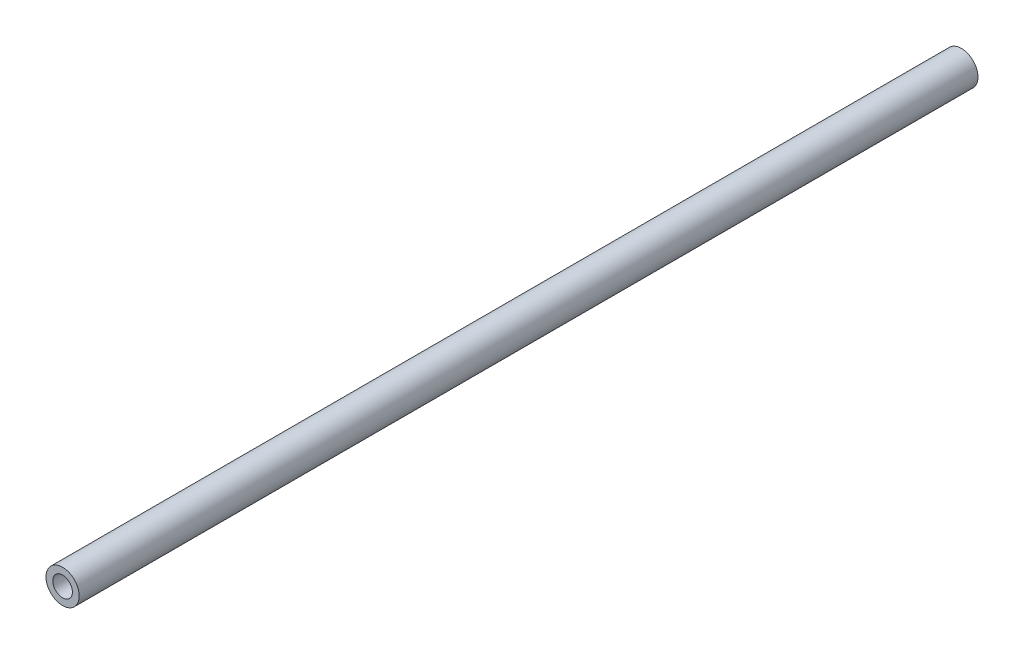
from build123d import *

# Parameters (mm, degrees)
SKETCH1_R           = 13.5
SKETCH1_R_2         = 8
BOSS_EXTRUDE1_DEPTH = 730


with BuildPart() as part:
    # Sketch1 → Boss-Extrude1 (new body)
    with BuildSketch(Plane.XY):
        Circle(SKETCH1_R)
        Circle(SKETCH1_R_2, mode=Mode.SUBTRACT)
    extrude(amount=-BOSS_EXTRUDE1_DEPTH)


solid = part.part
